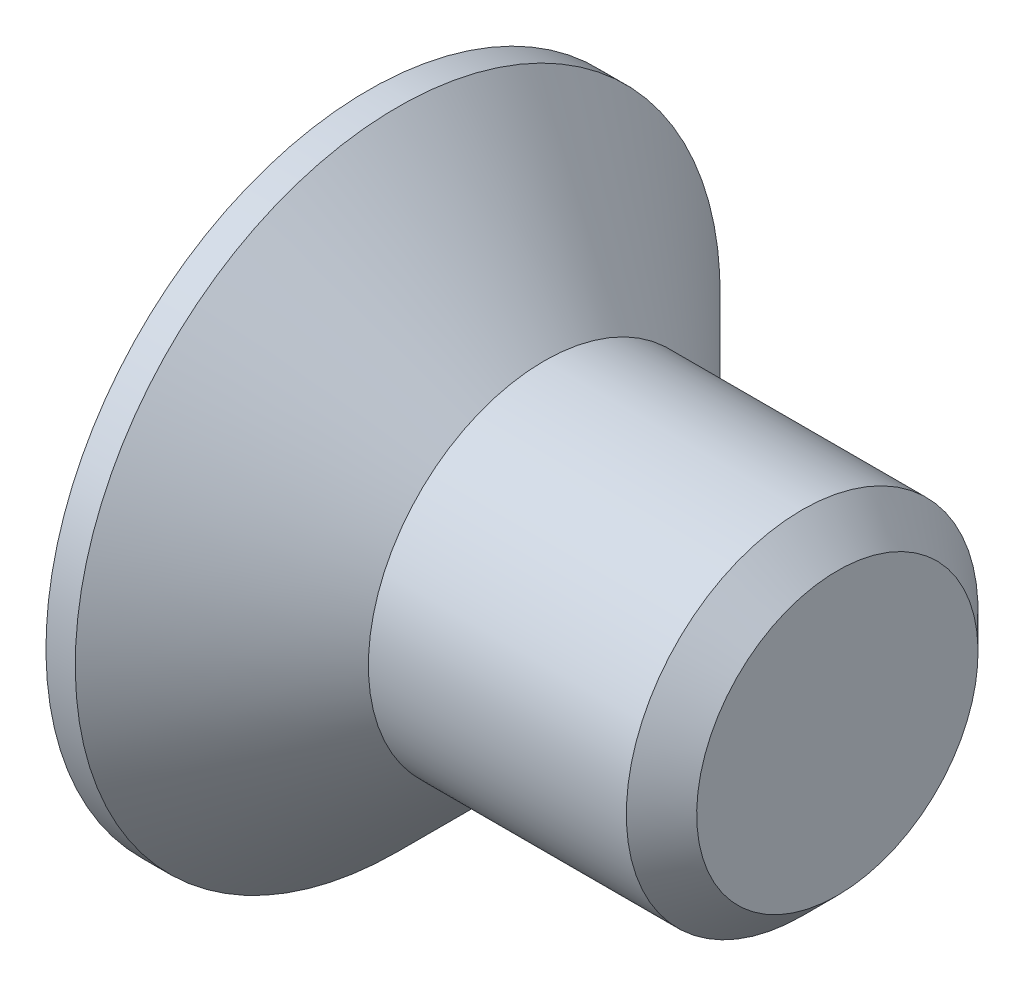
from build123d import *

# Parameters (mm, degrees)
CHAMFER1_SIZE      = 0.6
CUT_EXTRUDE1_DEPTH = 2.5


with BuildPart() as part:
    # Sketch1 → Revolve1 (revolve)
    with BuildSketch(Plane.XY, mode=Mode.PRIVATE) as revolve1_sk:
        Polygon((-3, 5.5), (-3, 0), (5, 0), (5, 3), (0, 3), (-2.5, 5.5), align=None)
    revolve(revolve1_sk.sketch.rotate(Axis((-3, 0, 0), (1, 0, 0)), 180), axis=Axis((-3, 0, 0), (1, 0, 0)))

    # Chamfer1
    chamfer1_edges = [part.edges().sort_by_distance(p)[0] for p in [
        (5, 3, 0),
    ]]
    chamfer(chamfer1_edges, length=CHAMFER1_SIZE)

    # Sketch2 → Cut-Extrude1 (cut)
    with BuildSketch(Plane.ZY.offset(3)):
        Polygon((-0.825, 3.3), (0.825, 3.3), (0.825, 0.825), (3.3, 0.825), (3.3, -0.825), (0.825, -0.825), (0.825, -3.3), (-0.825, -3.3), (-0.825, -0.825), (-3.3, -0.825), (-3.3, 0.825), (-0.825, 0.825), align=None)
    extrude(amount=-CUT_EXTRUDE1_DEPTH, mode=Mode.SUBTRACT)


solid = part.part
